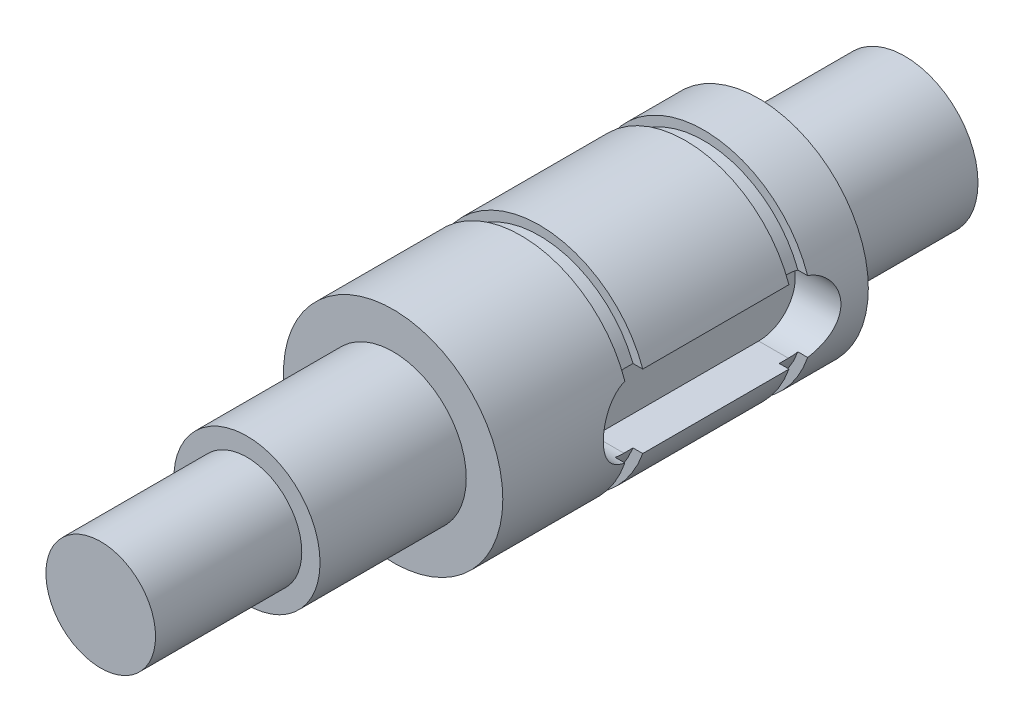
ISO-10303-21;
HEADER;
FILE_DESCRIPTION(('STEP AP214'),'2;1');
FILE_NAME('part.step','',(''),(''),'','','');
FILE_SCHEMA(('AUTOMOTIVE_DESIGN { 1 0 10303 214 1 1 1 1 }'));
ENDSEC;
DATA;
#1=APPLICATION_CONTEXT('core data for automotive mechanical design processes');
#2=APPLICATION_PROTOCOL_DEFINITION('international standard','automotive_design',2000,#1);
#3=PRODUCT_CONTEXT('',#1,'mechanical');
#4=PRODUCT('Part','Part','',(#3));
#5=PRODUCT_RELATED_PRODUCT_CATEGORY('part','',(#4));
#6=PRODUCT_DEFINITION_FORMATION('','',#4);
#7=PRODUCT_DEFINITION_CONTEXT('part definition',#1,'design');
#8=PRODUCT_DEFINITION('design','',#6,#7);
#9=PRODUCT_DEFINITION_SHAPE('','',#8);
#10=(LENGTH_UNIT() NAMED_UNIT(*) SI_UNIT(.MILLI.,.METRE.));
#11=(NAMED_UNIT(*) PLANE_ANGLE_UNIT() SI_UNIT($,.RADIAN.));
#12=(NAMED_UNIT(*) SI_UNIT($,.STERADIAN.) SOLID_ANGLE_UNIT());
#13=UNCERTAINTY_MEASURE_WITH_UNIT(LENGTH_MEASURE(1.E-05),#10,'distance_accuracy_value','');
#14=(GEOMETRIC_REPRESENTATION_CONTEXT(3) GLOBAL_UNCERTAINTY_ASSIGNED_CONTEXT((#13)) GLOBAL_UNIT_ASSIGNED_CONTEXT((#10,
#11,#12)) REPRESENTATION_CONTEXT('',''));
#15=CARTESIAN_POINT('',(0.,0.,0.));
#16=DIRECTION('',(0.,0.,1.));
#17=DIRECTION('',(1.,0.,0.));
#18=AXIS2_PLACEMENT_3D('',#15,#16,#17);
#19=CARTESIAN_POINT('',(0.,1.0547118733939E-12,20.));
#20=DIRECTION('',(0.,0.,-1.));
#21=DIRECTION('',(-1.,0.,0.));
#22=AXIS2_PLACEMENT_3D('',#19,#20,#21);
#23=CYLINDRICAL_SURFACE('',#22,6.);
#24=DIRECTION('',(0.,0.,-1.));
#25=VECTOR('',#24,1.);
#26=CARTESIAN_POINT('',(5.65685424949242,-1.99999999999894,20.));
#27=LINE('',#26,#25);
#28=CARTESIAN_POINT('',(5.65685424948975,-1.99999999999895,12.0000000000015));
#29=VERTEX_POINT('',#28);
#30=CARTESIAN_POINT('',(5.65685424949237,-1.99999999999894,4.00000000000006));
#31=VERTEX_POINT('',#30);
#32=EDGE_CURVE('E655',#29,#31,#27,.T.);
#33=ORIENTED_EDGE('',*,*,#32,.F.);
#34=CARTESIAN_POINT('',(0.,2.92917971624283E-12,12.0000000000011));
#35=DIRECTION('',(0.,1.87517412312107E-13,1.));
#36=DIRECTION('',(0.,-1.,1.87517412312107E-13));
#37=AXIS2_PLACEMENT_3D('',#34,#35,#36);
#38=CIRCLE('',#37,5.99999999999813);
#39=CARTESIAN_POINT('',(5.65685424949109,2.00000000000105,12.0000000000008));
#40=VERTEX_POINT('',#39);
#41=EDGE_CURVE('E511',#40,#29,#38,.T.);
#42=ORIENTED_EDGE('',*,*,#41,.F.);
#43=DIRECTION('',(0.,0.,-1.));
#44=VECTOR('',#43,1.);
#45=CARTESIAN_POINT('',(5.65685424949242,2.00000000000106,20.));
#46=LINE('',#45,#44);
#47=CARTESIAN_POINT('',(5.65685424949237,2.00000000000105,4.));
#48=VERTEX_POINT('',#47);
#49=EDGE_CURVE('E644',#48,#40,#46,.F.);
#50=ORIENTED_EDGE('',*,*,#49,.F.);
#51=CARTESIAN_POINT('',(0.,1.42904041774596E-12,4.00000000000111));
#52=DIRECTION('',(0.,1.87517412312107E-13,1.));
#53=DIRECTION('',(0.,-1.,1.87517412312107E-13));
#54=AXIS2_PLACEMENT_3D('',#51,#52,#53);
#55=CIRCLE('',#54,5.99999999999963);
#56=EDGE_CURVE('E520',#48,#31,#55,.T.);
#57=ORIENTED_EDGE('',*,*,#56,.T.);
#58=EDGE_LOOP('',(#33,#42,#50,#57));
#59=FACE_BOUND('',#58,.T.);
#60=ADVANCED_FACE('F348',(#59),#23,.T.);
#61=CARTESIAN_POINT('',(0.,6.00000000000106,4.));
#62=DIRECTION('',(0.,-1.87517412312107E-13,-1.));
#63=DIRECTION('',(0.,1.,-1.87517412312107E-13));
#64=AXIS2_PLACEMENT_3D('',#61,#62,#63);
#65=PLANE('',#64);
#66=CARTESIAN_POINT('',(0.,1.42904041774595E-12,4.000000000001));
#67=DIRECTION('',(0.,1.87517412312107E-13,1.));
#68=DIRECTION('',(0.,-1.,1.87517412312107E-13));
#69=AXIS2_PLACEMENT_3D('',#66,#67,#68);
#70=CIRCLE('',#69,5.49999999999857);
#71=CARTESIAN_POINT('',(5.12347538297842,2.00000000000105,4.00000000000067));
#72=VERTEX_POINT('',#71);
#73=CARTESIAN_POINT('',(5.12347538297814,-1.99999999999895,4.0000000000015));
#74=VERTEX_POINT('',#73);
#75=EDGE_CURVE('E534',#72,#74,#70,.T.);
#76=ORIENTED_EDGE('',*,*,#75,.T.);
#77=DIRECTION('',(1.,0.,0.));
#78=VECTOR('',#77,1.);
#79=CARTESIAN_POINT('',(0.,-1.99999999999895,4.00000000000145));
#80=LINE('',#79,#78);
#81=EDGE_CURVE('E652',#74,#31,#80,.T.);
#82=ORIENTED_EDGE('',*,*,#81,.T.);
#83=ORIENTED_EDGE('',*,*,#56,.F.);
#84=DIRECTION('',(-1.,0.,0.));
#85=VECTOR('',#84,1.);
#86=CARTESIAN_POINT('',(0.,2.00000000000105,4.00000000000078));
#87=LINE('',#86,#85);
#88=EDGE_CURVE('E642',#48,#72,#87,.T.);
#89=ORIENTED_EDGE('',*,*,#88,.T.);
#90=EDGE_LOOP('',(#76,#82,#83,#89));
#91=FACE_BOUND('',#90,.T.);
#92=ADVANCED_FACE('F583',(#91),#65,.T.);
#93=CARTESIAN_POINT('',(0.,1.0547118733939E-12,2.00376647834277));
#94=DIRECTION('',(0.,1.87517412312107E-13,1.));
#95=DIRECTION('',(0.,-1.,1.87517412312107E-13));
#96=AXIS2_PLACEMENT_3D('',#93,#94,#95);
#97=CYLINDRICAL_SURFACE('',#96,5.49999999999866);
#98=CARTESIAN_POINT('',(5.49999999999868,1.0547118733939E-12,5.49999999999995));
#99=CARTESIAN_POINT('',(5.50000205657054,0.108543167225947,5.50000281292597));
#100=CARTESIAN_POINT('',(5.49675838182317,0.217066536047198,5.49113580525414));
#101=CARTESIAN_POINT('',(5.4841414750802,0.430882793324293,5.45603554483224));
#102=CARTESIAN_POINT('',(5.47476871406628,0.536175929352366,5.42980362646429));
#103=CARTESIAN_POINT('',(5.45090325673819,0.740417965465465,5.36101528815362));
#104=CARTESIAN_POINT('',(5.4364200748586,0.83937825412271,5.31848919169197));
#105=CARTESIAN_POINT('',(5.40378627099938,1.02875621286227,5.21846905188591));
#106=CARTESIAN_POINT('',(5.38563473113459,1.11917173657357,5.16097126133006));
#107=CARTESIAN_POINT('',(5.34673088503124,1.29253694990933,5.03021601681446));
#108=CARTESIAN_POINT('',(5.32590805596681,1.37509612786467,4.95646195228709));
#109=CARTESIAN_POINT('',(5.284366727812,1.52698399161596,4.79634225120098));
#110=CARTESIAN_POINT('',(5.2636482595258,1.59630897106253,4.70997309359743));
#111=CARTESIAN_POINT('',(5.22385385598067,1.72217040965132,4.5233449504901));
#112=CARTESIAN_POINT('',(5.20486193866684,1.77816779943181,4.42270272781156));
#113=CARTESIAN_POINT('',(5.17176122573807,1.87226939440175,4.21262852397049));
#114=CARTESIAN_POINT('',(5.15765061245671,1.91038026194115,4.10319983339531));
#115=CARTESIAN_POINT('',(5.13666087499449,1.96610676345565,3.88314134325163));
#116=CARTESIAN_POINT('',(5.12952103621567,1.9844641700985,3.77272506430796));
#117=CARTESIAN_POINT('',(5.12251577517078,2.00248218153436,3.55016624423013));
#118=CARTESIAN_POINT('',(5.12264757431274,2.00214992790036,3.43802437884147));
#119=CARTESIAN_POINT('',(5.12994485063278,1.98336767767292,3.22184779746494));
#120=CARTESIAN_POINT('',(5.13671788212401,1.96592854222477,3.11770959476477));
#121=CARTESIAN_POINT('',(5.15588510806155,1.91509242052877,2.91395353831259));
#122=CARTESIAN_POINT('',(5.1682800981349,1.88169317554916,2.81433632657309));
#123=CARTESIAN_POINT('',(5.19754287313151,1.79930048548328,2.6203236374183));
#124=CARTESIAN_POINT('',(5.21448789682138,1.75003450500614,2.52605605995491));
#125=CARTESIAN_POINT('',(5.25091385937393,1.6374964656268,2.34682524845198));
#126=CARTESIAN_POINT('',(5.27039563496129,1.57421978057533,2.26186510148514));
#127=CARTESIAN_POINT('',(5.31119569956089,1.4307667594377,2.09804029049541));
#128=CARTESIAN_POINT('',(5.33255243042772,1.34977782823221,2.01989508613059));
#129=CARTESIAN_POINT('',(5.37363749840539,1.17559287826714,1.87808898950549));
#130=CARTESIAN_POINT('',(5.39336561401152,1.08239520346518,1.81443006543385));
#131=CARTESIAN_POINT('',(5.42932219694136,0.884691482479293,1.7026728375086));
#132=CARTESIAN_POINT('',(5.4454987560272,0.780047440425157,1.65480077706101));
#133=CARTESIAN_POINT('',(5.47214720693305,0.563457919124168,1.57757485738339));
#134=CARTESIAN_POINT('',(5.48262147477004,0.451515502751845,1.54821328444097));
#135=CARTESIAN_POINT('',(5.496274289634,0.229572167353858,1.51019398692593));
#136=CARTESIAN_POINT('',(5.499794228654,0.119758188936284,1.50056653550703));
#137=CARTESIAN_POINT('',(5.50018795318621,-0.0999591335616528,1.49948246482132));
#138=CARTESIAN_POINT('',(5.4970631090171,-0.209862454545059,1.50802209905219));
#139=CARTESIAN_POINT('',(5.48474392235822,-0.42253626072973,1.5422834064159));
#140=CARTESIAN_POINT('',(5.47577009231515,-0.525421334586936,1.56738122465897));
#141=CARTESIAN_POINT('',(5.45287588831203,-0.725457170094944,1.63323685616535));
#142=CARTESIAN_POINT('',(5.43895487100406,-0.822607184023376,1.67399670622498));
#143=CARTESIAN_POINT('',(5.40705571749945,-1.01153077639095,1.77129555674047));
#144=CARTESIAN_POINT('',(5.38897272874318,-1.10307043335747,1.8282533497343));
#145=CARTESIAN_POINT('',(5.3507652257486,-1.27559067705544,1.95585309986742));
#146=CARTESIAN_POINT('',(5.33063999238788,-1.3565675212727,2.02649988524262));
#147=CARTESIAN_POINT('',(5.289211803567,-1.51027155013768,2.18400778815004));
#148=CARTESIAN_POINT('',(5.26790441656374,-1.58230898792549,2.27154255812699));
#149=CARTESIAN_POINT('',(5.22759328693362,-1.71079410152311,2.45789098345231));
#150=CARTESIAN_POINT('',(5.20858968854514,-1.76724080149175,2.55670534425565));
#151=CARTESIAN_POINT('',(5.17515419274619,-1.86289185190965,2.76337294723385));
#152=CARTESIAN_POINT('',(5.16073201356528,-1.90205961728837,2.87124479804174));
#153=CARTESIAN_POINT('',(5.13846087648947,-1.96143954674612,3.09271744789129));
#154=CARTESIAN_POINT('',(5.13060817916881,-1.9816624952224,3.20631494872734));
#155=CARTESIAN_POINT('',(5.12284228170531,-2.00164701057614,3.42859130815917));
#156=CARTESIAN_POINT('',(5.12247623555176,-2.00257568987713,3.53715036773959));
#157=CARTESIAN_POINT('',(5.12857566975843,-1.98690232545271,3.75278956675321));
#158=CARTESIAN_POINT('',(5.13504057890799,-1.97030174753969,3.85986982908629));
#159=CARTESIAN_POINT('',(5.15370717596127,-1.92092825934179,4.06659495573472));
#160=CARTESIAN_POINT('',(5.16574946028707,-1.88860353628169,4.16636245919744));
#161=CARTESIAN_POINT('',(5.19413013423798,-1.80908422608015,4.3591227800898));
#162=CARTESIAN_POINT('',(5.21046957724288,-1.76188599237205,4.45211392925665));
#163=CARTESIAN_POINT('',(5.24662240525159,-1.65121147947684,4.63374145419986));
#164=CARTESIAN_POINT('',(5.26656880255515,-1.58703826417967,4.72192639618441));
#165=CARTESIAN_POINT('',(5.30720401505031,-1.44534172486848,4.88665015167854));
#166=CARTESIAN_POINT('',(5.32789305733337,-1.36781428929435,4.96318536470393));
#167=CARTESIAN_POINT('',(5.36891606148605,-1.19700369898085,5.10629946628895));
#168=CARTESIAN_POINT('',(5.38918141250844,-1.10312945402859,5.17219549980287));
#169=CARTESIAN_POINT('',(5.42597802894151,-0.904935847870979,5.28723707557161));
#170=CARTESIAN_POINT('',(5.44250937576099,-0.800616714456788,5.33638298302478));
#171=CARTESIAN_POINT('',(5.47019903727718,-0.582422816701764,5.41690966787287));
#172=CARTESIAN_POINT('',(5.48125425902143,-0.468408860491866,5.44795140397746));
#173=CARTESIAN_POINT('',(5.49615207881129,-0.236254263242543,5.48949064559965));
#174=CARTESIAN_POINT('',(5.49999776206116,-0.118115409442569,5.49999693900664));
#175=CARTESIAN_POINT('',(5.49999999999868,1.0547118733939E-12,5.49999999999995));
#176=B_SPLINE_CURVE_WITH_KNOTS('',3,(#98,#99,#100,#101,#102,#103,#104,#105,#106,#107,#108,#109,
#110,#111,#112,#113,#114,#115,#116,#117,#118,#119,#120,#121,#122,#123,#124,#125,#126,#127,#128,
#129,#130,#131,#132,#133,#134,#135,#136,#137,#138,#139,#140,#141,#142,#143,#144,#145,#146,#147,
#148,#149,#150,#151,#152,#153,#154,#155,#156,#157,#158,#159,#160,#161,#162,#163,#164,#165,#166,
#167,#168,#169,#170,#171,#172,#173,#174,#175),.UNSPECIFIED.,.T.,.F.,(4,2,2,2,2,2,2,2,2,2,2,2,2,
2,2,2,2,2,2,2,2,2,2,2,2,2,2,2,2,2,2,2,2,2,2,2,2,2,4),(0.,0.325194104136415,0.65036322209,
0.974930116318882,1.29957832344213,1.63601964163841,1.97255504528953,2.32099392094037,
2.66930290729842,3.00401939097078,3.33860797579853,3.65454759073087,3.97053193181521,
4.29226244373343,4.61409934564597,4.95617818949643,5.29830348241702,5.64513792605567,
5.99182774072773,6.32102805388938,6.65016048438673,6.96755079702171,7.28498239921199,
7.61151258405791,7.93815814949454,8.28259860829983,8.62706062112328,8.97224851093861,
9.31723978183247,9.64129740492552,9.96532793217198,10.280620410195,10.5959902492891,
10.9271566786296,11.2584252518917,11.6061385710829,11.9538443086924,12.3078682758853,
12.6617407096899),.UNSPECIFIED.);
#177=CARTESIAN_POINT('',(5.14781507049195,-1.93649167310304,3.0000000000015));
#178=VERTEX_POINT('',#177);
#179=CARTESIAN_POINT('',(5.12347538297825,-1.99999999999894,3.5));
#180=VERTEX_POINT('',#179);
#181=EDGE_CURVE('E610',#178,#180,#176,.T.);
#182=ORIENTED_EDGE('',*,*,#181,.T.);
#183=DIRECTION('',(0.,1.87517412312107E-13,1.));
#184=VECTOR('',#183,1.);
#185=CARTESIAN_POINT('',(5.12347538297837,-1.99999999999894,2.00376647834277));
#186=LINE('',#185,#184);
#187=EDGE_CURVE('E654',#180,#74,#186,.T.);
#188=ORIENTED_EDGE('',*,*,#187,.T.);
#189=ORIENTED_EDGE('',*,*,#75,.F.);
#190=DIRECTION('',(0.,1.87517412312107E-13,1.));
#191=VECTOR('',#190,1.);
#192=CARTESIAN_POINT('',(5.12347538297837,2.00000000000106,2.00376647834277));
#193=LINE('',#192,#191);
#194=CARTESIAN_POINT('',(5.12347538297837,2.00000000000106,3.49999999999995));
#195=VERTEX_POINT('',#194);
#196=EDGE_CURVE('E647',#72,#195,#193,.F.);
#197=ORIENTED_EDGE('',*,*,#196,.T.);
#198=CARTESIAN_POINT('',(5.14781507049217,1.93649167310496,3.00000000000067));
#199=VERTEX_POINT('',#198);
#200=EDGE_CURVE('E609',#195,#199,#176,.T.);
#201=ORIENTED_EDGE('',*,*,#200,.T.);
#202=CARTESIAN_POINT('',(0.,1.24152300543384E-12,3.000000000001));
#203=DIRECTION('',(0.,1.87517412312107E-13,1.));
#204=DIRECTION('',(0.,-1.,1.87517412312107E-13));
#205=AXIS2_PLACEMENT_3D('',#202,#203,#204);
#206=CIRCLE('',#205,5.49999999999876);
#207=EDGE_CURVE('E531',#199,#178,#206,.T.);
#208=ORIENTED_EDGE('',*,*,#207,.T.);
#209=EDGE_LOOP('',(#182,#188,#189,#197,#201,#208));
#210=FACE_BOUND('',#209,.T.);
#211=ADVANCED_FACE('F590',(#210),#97,.T.);
#212=CARTESIAN_POINT('',(0.,6.00000000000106,3.));
#213=DIRECTION('',(0.,1.87517412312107E-13,1.));
#214=DIRECTION('',(0.,-1.,1.87517412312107E-13));
#215=AXIS2_PLACEMENT_3D('',#212,#213,#214);
#216=PLANE('',#215);
#217=ORIENTED_EDGE('',*,*,#207,.F.);
#218=DIRECTION('',(-1.,0.,0.));
#219=VECTOR('',#218,1.);
#220=CARTESIAN_POINT('',(6.00000000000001,1.93649167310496,3.00000000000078));
#221=LINE('',#220,#219);
#222=CARTESIAN_POINT('',(5.67890834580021,1.93649167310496,3.00000000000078));
#223=VERTEX_POINT('',#222);
#224=EDGE_CURVE('E373',#199,#223,#221,.F.);
#225=ORIENTED_EDGE('',*,*,#224,.T.);
#226=CARTESIAN_POINT('',(0.,1.24152300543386E-12,3.00000000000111));
#227=DIRECTION('',(0.,1.87517412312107E-13,1.));
#228=DIRECTION('',(0.,-1.,1.87517412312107E-13));
#229=AXIS2_PLACEMENT_3D('',#226,#227,#228);
#230=CIRCLE('',#229,5.99999999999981);
#231=CARTESIAN_POINT('',(5.67890834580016,-1.93649167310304,3.00000000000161));
#232=VERTEX_POINT('',#231);
#233=EDGE_CURVE('E528',#223,#232,#230,.T.);
#234=ORIENTED_EDGE('',*,*,#233,.T.);
#235=DIRECTION('',(-1.,0.,0.));
#236=VECTOR('',#235,1.);
#237=CARTESIAN_POINT('',(6.00000000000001,-1.93649167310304,3.0000000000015));
#238=LINE('',#237,#236);
#239=EDGE_CURVE('E657',#232,#178,#238,.T.);
#240=ORIENTED_EDGE('',*,*,#239,.T.);
#241=EDGE_LOOP('',(#217,#225,#234,#240));
#242=FACE_BOUND('',#241,.T.);
#243=ADVANCED_FACE('F595',(#242),#216,.T.);
#244=CARTESIAN_POINT('',(0.,1.0547118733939E-12,0.));
#245=DIRECTION('',(0.,0.,1.));
#246=DIRECTION('',(1.,0.,0.));
#247=AXIS2_PLACEMENT_3D('',#244,#245,#246);
#248=CIRCLE('',#247,6.);
#249=CARTESIAN_POINT('',(6.,1.0547118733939E-12,0.));
#250=VERTEX_POINT('',#249);
#251=EDGE_CURVE('E552',#250,#250,#248,.T.);
#252=ORIENTED_EDGE('',*,*,#251,.T.);
#253=EDGE_LOOP('',(#252));
#254=FACE_BOUND('',#253,.T.);
#255=CARTESIAN_POINT('',(6.00000000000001,1.0547118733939E-12,5.49999999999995));
#256=CARTESIAN_POINT('',(6.00000030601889,-0.10912672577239,5.50000050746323));
#257=CARTESIAN_POINT('',(5.9969953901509,-0.218250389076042,5.49103946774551));
#258=CARTESIAN_POINT('',(5.98530420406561,-0.433283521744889,5.45554178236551));
#259=CARTESIAN_POINT('',(5.97661734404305,-0.539192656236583,5.42900331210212));
#260=CARTESIAN_POINT('',(5.95450615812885,-0.744665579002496,5.35936151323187));
#261=CARTESIAN_POINT('',(5.94108975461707,-0.844239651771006,5.31628587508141));
#262=CARTESIAN_POINT('',(5.91088891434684,-1.03474987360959,5.21491765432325));
#263=CARTESIAN_POINT('',(5.89410381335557,-1.12568431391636,5.15662206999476));
#264=CARTESIAN_POINT('',(5.85828188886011,-1.29948335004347,5.02434839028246));
#265=CARTESIAN_POINT('',(5.8391911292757,-1.38200740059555,4.94993753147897));
#266=CARTESIAN_POINT('',(5.80120629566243,-1.5336653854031,4.78846569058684));
#267=CARTESIAN_POINT('',(5.78231226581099,-1.60279637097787,4.70140193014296));
#268=CARTESIAN_POINT('',(5.74626664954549,-1.72764988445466,4.51402976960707));
#269=CARTESIAN_POINT('',(5.72918078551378,-1.78292971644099,4.41341252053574));
#270=CARTESIAN_POINT('',(5.69950610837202,-1.87563774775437,4.2036478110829));
#271=CARTESIAN_POINT('',(5.6869159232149,-1.91307139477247,4.09450296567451));
#272=CARTESIAN_POINT('',(5.66822606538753,-1.96774692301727,3.8746535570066));
#273=CARTESIAN_POINT('',(5.66192191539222,-1.98562689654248,3.7641255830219));
#274=CARTESIAN_POINT('',(5.65591313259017,-2.00268224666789,3.54147249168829));
#275=CARTESIAN_POINT('',(5.65620646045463,-2.00186340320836,3.42934787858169));
#276=CARTESIAN_POINT('',(5.66318030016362,-1.98203980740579,3.21212673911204));
#277=CARTESIAN_POINT('',(5.66956831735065,-1.96386782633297,3.10694319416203));
#278=CARTESIAN_POINT('',(5.68753315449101,-1.91121232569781,2.90121316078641));
#279=CARTESIAN_POINT('',(5.69911059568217,-1.87672685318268,2.80066722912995));
#280=CARTESIAN_POINT('',(5.72635822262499,-1.79187811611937,2.6051745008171));
#281=CARTESIAN_POINT('',(5.74209131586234,-1.7412680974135,2.51034394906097));
#282=CARTESIAN_POINT('',(5.77585117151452,-1.62577821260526,2.33025818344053));
#283=CARTESIAN_POINT('',(5.79387859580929,-1.56089422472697,2.24500574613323));
#284=CARTESIAN_POINT('',(5.83134658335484,-1.41469866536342,2.08181680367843));
#285=CARTESIAN_POINT('',(5.85081178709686,-1.33270630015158,2.00449461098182));
#286=CARTESIAN_POINT('',(5.88813876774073,-1.15667913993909,1.86453746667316));
#287=CARTESIAN_POINT('',(5.90600039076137,-1.06264319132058,1.80190392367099));
#288=CARTESIAN_POINT('',(5.93834215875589,-0.863895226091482,1.69260739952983));
#289=CARTESIAN_POINT('',(5.95278700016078,-0.759086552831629,1.64610901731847));
#290=CARTESIAN_POINT('',(5.9764113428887,-0.542538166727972,1.57159365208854));
#291=CARTESIAN_POINT('',(5.98559267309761,-0.430800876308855,1.54357024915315));
#292=CARTESIAN_POINT('',(5.99735254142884,-0.208767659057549,1.50788866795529));
#293=CARTESIAN_POINT('',(6.00020003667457,-0.098619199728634,1.49940038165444));
#294=CARTESIAN_POINT('',(5.99977805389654,0.121550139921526,1.50066534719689));
#295=CARTESIAN_POINT('',(5.99650960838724,0.231571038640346,1.5104155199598));
#296=CARTESIAN_POINT('',(5.98440049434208,0.445039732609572,1.54722381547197));
#297=CARTESIAN_POINT('',(5.97572397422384,0.54858561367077,1.57377241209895));
#298=CARTESIAN_POINT('',(5.9538369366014,0.749711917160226,1.6427868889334));
#299=CARTESIAN_POINT('',(5.9406258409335,0.847291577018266,1.68525479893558));
#300=CARTESIAN_POINT('',(5.91057862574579,1.0365765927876,1.7861408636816));
#301=CARTESIAN_POINT('',(5.89365629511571,1.12805991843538,1.84494918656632));
#302=CARTESIAN_POINT('',(5.85810507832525,1.30012966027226,1.97638830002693));
#303=CARTESIAN_POINT('',(5.83947567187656,1.38071273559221,2.04902331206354));
#304=CARTESIAN_POINT('',(5.8015369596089,1.53250501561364,2.2099575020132));
#305=CARTESIAN_POINT('',(5.78223522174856,1.60312193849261,2.29881845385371));
#306=CARTESIAN_POINT('',(5.74599946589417,1.72851504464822,2.48754313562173));
#307=CARTESIAN_POINT('',(5.72906546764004,1.78329109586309,2.5874069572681));
#308=CARTESIAN_POINT('',(5.69964783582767,1.87519386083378,2.79534603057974));
#309=CARTESIAN_POINT('',(5.68715521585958,1.9123562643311,2.90340415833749));
#310=CARTESIAN_POINT('',(5.66821664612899,1.96778933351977,3.12475730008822));
#311=CARTESIAN_POINT('',(5.66176797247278,1.98606850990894,3.23804993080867));
#312=CARTESIAN_POINT('',(5.65595717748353,2.00255256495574,3.46039419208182));
#313=CARTESIAN_POINT('',(5.6562480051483,2.00174051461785,3.56936468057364));
#314=CARTESIAN_POINT('',(5.66302539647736,1.98248458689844,3.78553014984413));
#315=CARTESIAN_POINT('',(5.66951159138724,1.96404175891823,3.89272523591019));
#316=CARTESIAN_POINT('',(5.68769048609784,1.91074362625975,4.10027132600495));
#317=CARTESIAN_POINT('',(5.69928196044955,1.87620669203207,4.20071365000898));
#318=CARTESIAN_POINT('',(5.72632797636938,1.79195873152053,4.3944548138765));
#319=CARTESIAN_POINT('',(5.7417833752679,1.74224433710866,4.48775206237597));
#320=CARTESIAN_POINT('',(5.77565658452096,1.62652138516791,4.66896733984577));
#321=CARTESIAN_POINT('',(5.79417423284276,1.55989648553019,4.75647300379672));
#322=CARTESIAN_POINT('',(5.83166712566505,1.41328576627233,4.91937962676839));
#323=CARTESIAN_POINT('',(5.85064249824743,1.33329616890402,4.99477715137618));
#324=CARTESIAN_POINT('',(5.88780061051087,1.15848311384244,5.13428882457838));
#325=CARTESIAN_POINT('',(5.90592363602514,1.06320302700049,5.19784869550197));
#326=CARTESIAN_POINT('',(5.93851982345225,0.862714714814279,5.30798085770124));
#327=CARTESIAN_POINT('',(5.95299391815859,0.757509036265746,5.35455749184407));
#328=CARTESIAN_POINT('',(5.97611030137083,0.544987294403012,5.42744326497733));
#329=CARTESIAN_POINT('',(5.98498424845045,0.43797551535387,5.45456493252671));
#330=CARTESIAN_POINT('',(5.99692814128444,0.220640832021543,5.49084056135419));
#331=CARTESIAN_POINT('',(5.99999969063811,0.110318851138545,5.49999948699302));
#332=CARTESIAN_POINT('',(6.00000000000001,1.0547118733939E-12,5.49999999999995));
#333=B_SPLINE_CURVE_WITH_KNOTS('',3,(#255,#256,#257,#258,#259,#260,#261,#262,#263,#264,#265,
#266,#267,#268,#269,#270,#271,#272,#273,#274,#275,#276,#277,#278,#279,#280,#281,#282,#283,#284,
#285,#286,#287,#288,#289,#290,#291,#292,#293,#294,#295,#296,#297,#298,#299,#300,#301,#302,#303,
#304,#305,#306,#307,#308,#309,#310,#311,#312,#313,#314,#315,#316,#317,#318,#319,#320,#321,#322,
#323,#324,#325,#326,#327,#328,#329,#330,#331,#332),.UNSPECIFIED.,.T.,.F.,(4,2,2,2,2,2,2,2,2,2,2,
2,2,2,2,2,2,2,2,2,2,2,2,2,2,2,2,2,2,2,2,2,2,2,2,2,2,2,4),(0.,0.326974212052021,
0.653982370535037,0.980445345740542,1.3069727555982,1.6436936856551,1.98048866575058,
2.32696769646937,2.67334089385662,3.00803851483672,3.34263267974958,3.66193653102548,
3.98127861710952,4.30576342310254,4.63034205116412,4.97186611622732,5.31342291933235,
5.65836811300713,6.00319337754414,6.33307166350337,6.66289426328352,6.98316315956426,
7.30347290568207,7.63220799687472,7.96104361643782,8.30482045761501,8.64860016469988,
8.99168027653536,9.33460569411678,9.65991332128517,9.98520158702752,10.3043117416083,
10.6234927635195,10.9566013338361,11.2898042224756,11.635993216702,11.9820936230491,
12.3127311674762,12.6432773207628),.UNSPECIFIED.);
#334=EDGE_CURVE('E11',#232,#223,#333,.T.);
#335=ORIENTED_EDGE('',*,*,#334,.F.);
#336=ORIENTED_EDGE('',*,*,#233,.F.);
#337=EDGE_LOOP('',(#335,#336));
#338=FACE_BOUND('',#337,.T.);
#339=ADVANCED_FACE('F585',(#254,#338),#23,.T.);
#340=CARTESIAN_POINT('',(0.,6.00000000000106,13.));
#341=DIRECTION('',(0.,-1.87517412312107E-13,-1.));
#342=DIRECTION('',(0.,1.,-1.87517412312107E-13));
#343=AXIS2_PLACEMENT_3D('',#340,#341,#342);
#344=PLANE('',#343);
#345=CARTESIAN_POINT('',(0.,3.11669712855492E-12,13.000000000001));
#346=DIRECTION('',(0.,1.87517412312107E-13,1.));
#347=DIRECTION('',(0.,-1.,1.87517412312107E-13));
#348=AXIS2_PLACEMENT_3D('',#345,#346,#347);
#349=CIRCLE('',#348,5.49999999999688);
#350=CARTESIAN_POINT('',(5.14781507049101,1.93649167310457,13.0000000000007));
#351=VERTEX_POINT('',#350);
#352=CARTESIAN_POINT('',(5.14781507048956,-1.93649167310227,13.0000000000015));
#353=VERTEX_POINT('',#352);
#354=EDGE_CURVE('E517',#351,#353,#349,.T.);
#355=ORIENTED_EDGE('',*,*,#354,.T.);
#356=DIRECTION('',(-1.,0.,0.));
#357=VECTOR('',#356,1.);
#358=CARTESIAN_POINT('',(6.00000000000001,-1.93649167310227,13.0000000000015));
#359=LINE('',#358,#357);
#360=CARTESIAN_POINT('',(5.67890834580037,-1.93649167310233,13.0000000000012));
#361=VERTEX_POINT('',#360);
#362=EDGE_CURVE('E473',#353,#361,#359,.F.);
#363=ORIENTED_EDGE('',*,*,#362,.T.);
#364=CARTESIAN_POINT('',(0.,3.11669712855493E-12,13.0000000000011));
#365=DIRECTION('',(0.,1.87517412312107E-13,1.));
#366=DIRECTION('',(0.,-1.,1.87517412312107E-13));
#367=AXIS2_PLACEMENT_3D('',#364,#365,#366);
#368=CIRCLE('',#367,5.99999999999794);
#369=CARTESIAN_POINT('',(5.67890834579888,1.93649167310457,13.0000000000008));
#370=VERTEX_POINT('',#369);
#371=EDGE_CURVE('E522',#370,#361,#368,.T.);
#372=ORIENTED_EDGE('',*,*,#371,.F.);
#373=DIRECTION('',(-1.,0.,0.));
#374=VECTOR('',#373,1.);
#375=CARTESIAN_POINT('',(6.00000000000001,1.93649167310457,13.0000000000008));
#376=LINE('',#375,#374);
#377=EDGE_CURVE('E366',#370,#351,#376,.T.);
#378=ORIENTED_EDGE('',*,*,#377,.T.);
#379=EDGE_LOOP('',(#355,#363,#372,#378));
#380=FACE_BOUND('',#379,.T.);
#381=ADVANCED_FACE('F594',(#380),#344,.T.);
#382=CARTESIAN_POINT('',(0.,1.0547118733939E-12,2.00376647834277));
#383=DIRECTION('',(0.,1.87517412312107E-13,1.));
#384=DIRECTION('',(0.,-1.,1.87517412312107E-13));
#385=AXIS2_PLACEMENT_3D('',#382,#383,#384);
#386=CYLINDRICAL_SURFACE('',#385,5.49999999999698);
#387=DIRECTION('',(0.,1.87517412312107E-13,1.));
#388=VECTOR('',#387,1.);
#389=CARTESIAN_POINT('',(5.12347538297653,-1.99999999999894,2.00376647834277));
#390=LINE('',#389,#388);
#391=CARTESIAN_POINT('',(5.12347538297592,-1.99999999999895,12.0000000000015));
#392=VERTEX_POINT('',#391);
#393=CARTESIAN_POINT('',(5.12347538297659,-1.99999999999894,12.5000000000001));
#394=VERTEX_POINT('',#393);
#395=EDGE_CURVE('E515',#392,#394,#390,.T.);
#396=ORIENTED_EDGE('',*,*,#395,.T.);
#397=CARTESIAN_POINT('',(5.49999999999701,1.0547118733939E-12,14.5000000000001));
#398=CARTESIAN_POINT('',(5.5000020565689,0.108543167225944,14.5000028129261));
#399=CARTESIAN_POINT('',(5.49675838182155,0.217066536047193,14.4911358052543));
#400=CARTESIAN_POINT('',(5.48414147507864,0.430882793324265,14.4560355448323));
#401=CARTESIAN_POINT('',(5.47476871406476,0.536175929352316,14.4298036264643));
#402=CARTESIAN_POINT('',(5.45090325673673,0.740417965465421,14.3610152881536));
#403=CARTESIAN_POINT('',(5.43642007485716,0.839378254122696,14.3184891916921));
#404=CARTESIAN_POINT('',(5.40378627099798,1.02875621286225,14.2184690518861));
#405=CARTESIAN_POINT('',(5.38563473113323,1.11917173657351,14.1609712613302));
#406=CARTESIAN_POINT('',(5.34673088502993,1.29253694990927,14.0302160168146));
#407=CARTESIAN_POINT('',(5.32590805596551,1.37509612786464,13.9564619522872));
#408=CARTESIAN_POINT('',(5.28436672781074,1.52698399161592,13.7963422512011));
#409=CARTESIAN_POINT('',(5.26364825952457,1.59630897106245,13.7099730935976));
#410=CARTESIAN_POINT('',(5.22385385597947,1.72217040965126,13.5233449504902));
#411=CARTESIAN_POINT('',(5.20486193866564,1.7781677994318,13.4227027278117));
#412=CARTESIAN_POINT('',(5.17176122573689,1.87226939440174,13.2126285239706));
#413=CARTESIAN_POINT('',(5.15765061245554,1.91038026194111,13.1031998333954));
#414=CARTESIAN_POINT('',(5.13666087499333,1.9661067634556,12.8831413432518));
#415=CARTESIAN_POINT('',(5.12952103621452,1.98446417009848,12.7727250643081));
#416=CARTESIAN_POINT('',(5.12251577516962,2.00248218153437,12.5501662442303));
#417=CARTESIAN_POINT('',(5.12264757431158,2.00214992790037,12.4380243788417));
#418=CARTESIAN_POINT('',(5.12994485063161,1.98336767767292,12.2218477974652));
#419=CARTESIAN_POINT('',(5.13671788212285,1.96592854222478,12.117709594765));
#420=CARTESIAN_POINT('',(5.15588510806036,1.91509242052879,11.9139535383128));
#421=CARTESIAN_POINT('',(5.16828009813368,1.8816931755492,11.8143363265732));
#422=CARTESIAN_POINT('',(5.19754287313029,1.79930048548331,11.6203236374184));
#423=CARTESIAN_POINT('',(5.21448789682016,1.75003450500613,11.526056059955));
#424=CARTESIAN_POINT('',(5.2509138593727,1.63749646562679,11.3468252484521));
#425=CARTESIAN_POINT('',(5.27039563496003,1.57421978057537,11.2618651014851));
#426=CARTESIAN_POINT('',(5.31119569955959,1.43076675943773,11.0980402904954));
#427=CARTESIAN_POINT('',(5.33255243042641,1.34977782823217,11.0198950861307));
#428=CARTESIAN_POINT('',(5.37363749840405,1.1755928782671,10.8780889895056));
#429=CARTESIAN_POINT('',(5.39336561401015,1.0823952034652,10.8144300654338));
#430=CARTESIAN_POINT('',(5.42932219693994,0.884691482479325,10.7026728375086));
#431=CARTESIAN_POINT('',(5.44549875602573,0.780047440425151,10.6548007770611));
#432=CARTESIAN_POINT('',(5.47214720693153,0.563457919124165,10.5775748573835));
#433=CARTESIAN_POINT('',(5.48262147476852,0.451515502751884,10.548213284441));
#434=CARTESIAN_POINT('',(5.49627428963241,0.22957216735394,10.5101939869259));
#435=CARTESIAN_POINT('',(5.49979422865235,0.11975818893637,10.5005665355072));
#436=CARTESIAN_POINT('',(5.50018795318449,-0.0999591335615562,10.4994824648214));
#437=CARTESIAN_POINT('',(5.49706310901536,-0.209862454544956,10.5080220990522));
#438=CARTESIAN_POINT('',(5.48474392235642,-0.422536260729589,10.5422834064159));
#439=CARTESIAN_POINT('',(5.47577009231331,-0.525421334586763,10.567381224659));
#440=CARTESIAN_POINT('',(5.45287588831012,-0.725457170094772,10.6332368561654));
#441=CARTESIAN_POINT('',(5.43895487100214,-0.822607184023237,10.6739967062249));
#442=CARTESIAN_POINT('',(5.40705571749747,-1.0115307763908,10.7712955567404));
#443=CARTESIAN_POINT('',(5.38897272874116,-1.10307043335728,10.8282533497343));
#444=CARTESIAN_POINT('',(5.3507652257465,-1.27559067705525,10.9558530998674));
#445=CARTESIAN_POINT('',(5.33063999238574,-1.35656752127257,11.0264998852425));
#446=CARTESIAN_POINT('',(5.2892118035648,-1.51027155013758,11.1840077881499));
#447=CARTESIAN_POINT('',(5.26790441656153,-1.58230898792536,11.2715425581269));
#448=CARTESIAN_POINT('',(5.22759328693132,-1.71079410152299,11.4578909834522));
#449=CARTESIAN_POINT('',(5.20858968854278,-1.76724080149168,11.5567053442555));
#450=CARTESIAN_POINT('',(5.17515419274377,-1.86289185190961,11.7633729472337));
#451=CARTESIAN_POINT('',(5.16073201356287,-1.9020596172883,11.8712447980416));
#452=CARTESIAN_POINT('',(5.13846087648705,-1.96143954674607,12.0927174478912));
#453=CARTESIAN_POINT('',(5.13060817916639,-1.98166249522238,12.2063149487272));
#454=CARTESIAN_POINT('',(5.12284228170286,-2.00164701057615,12.4285913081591));
#455=CARTESIAN_POINT('',(5.12247623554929,-2.00257568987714,12.5371503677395));
#456=CARTESIAN_POINT('',(5.12857566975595,-1.98690232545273,12.7527895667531));
#457=CARTESIAN_POINT('',(5.13504057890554,-1.97030174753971,12.8598698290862));
#458=CARTESIAN_POINT('',(5.15370717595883,-1.92092825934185,13.0665949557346));
#459=CARTESIAN_POINT('',(5.16574946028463,-1.88860353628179,13.1663624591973));
#460=CARTESIAN_POINT('',(5.19413013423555,-1.80908422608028,13.3591227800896));
#461=CARTESIAN_POINT('',(5.21046957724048,-1.76188599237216,13.4521139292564));
#462=CARTESIAN_POINT('',(5.24662240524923,-1.651211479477,13.6337414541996));
#463=CARTESIAN_POINT('',(5.26656880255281,-1.58703826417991,13.7219263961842));
#464=CARTESIAN_POINT('',(5.30720401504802,-1.44534172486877,13.8866501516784));
#465=CARTESIAN_POINT('',(5.32789305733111,-1.3678142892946,13.9631853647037));
#466=CARTESIAN_POINT('',(5.36891606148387,-1.19700369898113,14.1062994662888));
#467=CARTESIAN_POINT('',(5.3891814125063,-1.10312945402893,14.1721954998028));
#468=CARTESIAN_POINT('',(5.42597802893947,-0.904935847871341,14.2872370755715));
#469=CARTESIAN_POINT('',(5.44250937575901,-0.800616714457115,14.3363829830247));
#470=CARTESIAN_POINT('',(5.4701990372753,-0.582422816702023,14.4169096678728));
#471=CARTESIAN_POINT('',(5.48125425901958,-0.468408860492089,14.4479514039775));
#472=CARTESIAN_POINT('',(5.49615207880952,-0.236254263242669,14.4894906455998));
#473=CARTESIAN_POINT('',(5.49999776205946,-0.118115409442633,14.4999969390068));
#474=CARTESIAN_POINT('',(5.49999999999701,1.0547118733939E-12,14.5000000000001));
#475=B_SPLINE_CURVE_WITH_KNOTS('',3,(#397,#398,#399,#400,#401,#402,#403,#404,#405,#406,#407,
#408,#409,#410,#411,#412,#413,#414,#415,#416,#417,#418,#419,#420,#421,#422,#423,#424,#425,#426,
#427,#428,#429,#430,#431,#432,#433,#434,#435,#436,#437,#438,#439,#440,#441,#442,#443,#444,#445,
#446,#447,#448,#449,#450,#451,#452,#453,#454,#455,#456,#457,#458,#459,#460,#461,#462,#463,#464,
#465,#466,#467,#468,#469,#470,#471,#472,#473,#474),.UNSPECIFIED.,.T.,.F.,(4,2,2,2,2,2,2,2,2,2,2,
2,2,2,2,2,2,2,2,2,2,2,2,2,2,2,2,2,2,2,2,2,2,2,2,2,2,2,4),(0.,0.325194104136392,
0.650363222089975,0.974930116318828,1.29957832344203,1.63601964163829,1.97255504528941,
2.32099392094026,2.66930290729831,3.00401939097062,3.33860797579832,3.6545475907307,
3.97053193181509,4.29226244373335,4.61409934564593,4.95617818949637,5.29830348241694,
5.64513792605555,5.99182774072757,6.32102805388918,6.6501604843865,6.96755079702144,
7.28498239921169,7.61151258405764,7.93815814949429,8.28259860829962,8.62706062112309,
8.97224851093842,9.3172397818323,9.64129740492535,9.9653279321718,10.2806204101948,
10.5959902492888,10.9271566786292,11.2584252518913,11.6061385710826,11.9538443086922,
12.3078682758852,12.66174070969),.UNSPECIFIED.);
#476=EDGE_CURVE('E445',#394,#353,#475,.T.);
#477=ORIENTED_EDGE('',*,*,#476,.T.);
#478=ORIENTED_EDGE('',*,*,#354,.F.);
#479=CARTESIAN_POINT('',(5.12347538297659,2.00000000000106,12.5000000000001));
#480=VERTEX_POINT('',#479);
#481=EDGE_CURVE('E481',#351,#480,#475,.T.);
#482=ORIENTED_EDGE('',*,*,#481,.T.);
#483=DIRECTION('',(0.,1.87517412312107E-13,1.));
#484=VECTOR('',#483,1.);
#485=CARTESIAN_POINT('',(5.12347538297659,2.00000000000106,2.00376647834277));
#486=LINE('',#485,#484);
#487=CARTESIAN_POINT('',(5.12347538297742,2.00000000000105,12.0000000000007));
#488=VERTEX_POINT('',#487);
#489=EDGE_CURVE('E482',#480,#488,#486,.F.);
#490=ORIENTED_EDGE('',*,*,#489,.T.);
#491=CARTESIAN_POINT('',(0.,2.92917971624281E-12,12.000000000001));
#492=DIRECTION('',(0.,1.87517412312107E-13,1.));
#493=DIRECTION('',(0.,-1.,1.87517412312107E-13));
#494=AXIS2_PLACEMENT_3D('',#491,#492,#493);
#495=CIRCLE('',#494,5.49999999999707);
#496=EDGE_CURVE('E509',#488,#392,#495,.T.);
#497=ORIENTED_EDGE('',*,*,#496,.T.);
#498=EDGE_LOOP('',(#396,#477,#478,#482,#490,#497));
#499=FACE_BOUND('',#498,.T.);
#500=ADVANCED_FACE('F484',(#499),#386,.T.);
#501=CARTESIAN_POINT('',(0.,6.00000000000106,12.));
#502=DIRECTION('',(0.,1.87517412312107E-13,1.));
#503=DIRECTION('',(0.,-1.,1.87517412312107E-13));
#504=AXIS2_PLACEMENT_3D('',#501,#502,#503);
#505=PLANE('',#504);
#506=ORIENTED_EDGE('',*,*,#41,.T.);
#507=DIRECTION('',(-1.,0.,0.));
#508=VECTOR('',#507,1.);
#509=CARTESIAN_POINT('',(0.,-1.99999999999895,12.0000000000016));
#510=LINE('',#509,#508);
#511=EDGE_CURVE('E359',#29,#392,#510,.T.);
#512=ORIENTED_EDGE('',*,*,#511,.T.);
#513=ORIENTED_EDGE('',*,*,#496,.F.);
#514=DIRECTION('',(1.,0.,0.));
#515=VECTOR('',#514,1.);
#516=CARTESIAN_POINT('',(0.,2.00000000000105,12.0000000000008));
#517=LINE('',#516,#515);
#518=EDGE_CURVE('E500',#488,#40,#517,.T.);
#519=ORIENTED_EDGE('',*,*,#518,.T.);
#520=EDGE_LOOP('',(#506,#512,#513,#519));
#521=FACE_BOUND('',#520,.T.);
#522=ADVANCED_FACE('F492',(#521),#505,.T.);
#523=CARTESIAN_POINT('',(0.,1.0547118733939E-12,20.));
#524=DIRECTION('',(0.,0.,1.));
#525=DIRECTION('',(1.,0.,0.));
#526=AXIS2_PLACEMENT_3D('',#523,#524,#525);
#527=CIRCLE('',#526,6.);
#528=CARTESIAN_POINT('',(6.,1.0547118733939E-12,20.));
#529=VERTEX_POINT('',#528);
#530=EDGE_CURVE('E554',#529,#529,#527,.T.);
#531=ORIENTED_EDGE('',*,*,#530,.F.);
#532=EDGE_LOOP('',(#531));
#533=FACE_BOUND('',#532,.T.);
#534=ORIENTED_EDGE('',*,*,#371,.T.);
#535=CARTESIAN_POINT('',(6.00000000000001,1.0547118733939E-12,14.5000000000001));
#536=CARTESIAN_POINT('',(6.00000030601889,-0.109126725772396,14.5000005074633));
#537=CARTESIAN_POINT('',(5.9969953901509,-0.218250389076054,14.4910394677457));
#538=CARTESIAN_POINT('',(5.98530420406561,-0.433283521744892,14.4555417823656));
#539=CARTESIAN_POINT('',(5.97661734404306,-0.53919265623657,14.4290033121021));
#540=CARTESIAN_POINT('',(5.95450615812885,-0.744665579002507,14.3593615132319));
#541=CARTESIAN_POINT('',(5.94108975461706,-0.844239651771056,14.3162858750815));
#542=CARTESIAN_POINT('',(5.91088891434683,-1.03474987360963,14.2149176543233));
#543=CARTESIAN_POINT('',(5.89410381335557,-1.12568431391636,14.1566220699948));
#544=CARTESIAN_POINT('',(5.85828188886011,-1.29948335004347,14.0243483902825));
#545=CARTESIAN_POINT('',(5.83919112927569,-1.3820074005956,13.949937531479));
#546=CARTESIAN_POINT('',(5.80120629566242,-1.53366538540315,13.7884656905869));
#547=CARTESIAN_POINT('',(5.782312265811,-1.60279637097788,13.701401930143));
#548=CARTESIAN_POINT('',(5.74626664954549,-1.72764988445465,13.5140297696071));
#549=CARTESIAN_POINT('',(5.72918078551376,-1.78292971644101,13.4134125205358));
#550=CARTESIAN_POINT('',(5.69950610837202,-1.8756377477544,13.203647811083));
#551=CARTESIAN_POINT('',(5.68691592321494,-1.91307139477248,13.0945029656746));
#552=CARTESIAN_POINT('',(5.66822606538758,-1.96774692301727,12.8746535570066));
#553=CARTESIAN_POINT('',(5.66192191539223,-1.98562689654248,12.7641255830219));
#554=CARTESIAN_POINT('',(5.65591313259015,-2.0026822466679,12.5414724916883));
#555=CARTESIAN_POINT('',(5.65620646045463,-2.00186340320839,12.4293478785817));
#556=CARTESIAN_POINT('',(5.66318030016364,-1.98203980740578,12.212126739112));
#557=CARTESIAN_POINT('',(5.66956831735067,-1.96386782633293,12.106943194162));
#558=CARTESIAN_POINT('',(5.68753315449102,-1.91121232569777,11.9012131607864));
#559=CARTESIAN_POINT('',(5.69911059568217,-1.87672685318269,11.8006672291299));
#560=CARTESIAN_POINT('',(5.72635822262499,-1.79187811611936,11.6051745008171));
#561=CARTESIAN_POINT('',(5.74209131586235,-1.74126809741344,11.510343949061));
#562=CARTESIAN_POINT('',(5.77585117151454,-1.6257782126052,11.3302581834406));
#563=CARTESIAN_POINT('',(5.79387859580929,-1.56089422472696,11.2450057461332));
#564=CARTESIAN_POINT('',(5.83134658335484,-1.41469866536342,11.0818168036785));
#565=CARTESIAN_POINT('',(5.85081178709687,-1.33270630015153,11.0044946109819));
#566=CARTESIAN_POINT('',(5.88813876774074,-1.15667913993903,10.8645374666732));
#567=CARTESIAN_POINT('',(5.90600039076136,-1.06264319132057,10.801903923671));
#568=CARTESIAN_POINT('',(5.93834215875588,-0.863895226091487,10.6926073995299));
#569=CARTESIAN_POINT('',(5.95278700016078,-0.7590865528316,10.6461090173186));
#570=CARTESIAN_POINT('',(5.97641134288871,-0.542538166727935,10.5715936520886));
#571=CARTESIAN_POINT('',(5.98559267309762,-0.430800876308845,10.5435702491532));
#572=CARTESIAN_POINT('',(5.99735254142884,-0.208767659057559,10.5078886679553));
#573=CARTESIAN_POINT('',(6.00020003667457,-0.0986191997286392,10.4994003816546));
#574=CARTESIAN_POINT('',(5.99977805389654,0.121550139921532,10.500665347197));
#575=CARTESIAN_POINT('',(5.99650960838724,0.231571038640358,10.5104155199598));
#576=CARTESIAN_POINT('',(5.98440049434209,0.445039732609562,10.547223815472));
#577=CARTESIAN_POINT('',(5.97572397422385,0.548585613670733,10.5737724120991));
#578=CARTESIAN_POINT('',(5.9538369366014,0.749711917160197,10.6427868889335));
#579=CARTESIAN_POINT('',(5.94062584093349,0.847291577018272,10.6852547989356));
#580=CARTESIAN_POINT('',(5.91057862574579,1.0365765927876,10.7861408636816));
#581=CARTESIAN_POINT('',(5.89365629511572,1.12805991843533,10.8449491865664));
#582=CARTESIAN_POINT('',(5.85810507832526,1.30012966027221,10.976388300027));
#583=CARTESIAN_POINT('',(5.83947567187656,1.38071273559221,11.0490233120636));
#584=CARTESIAN_POINT('',(5.8015369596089,1.53250501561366,11.2099575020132));
#585=CARTESIAN_POINT('',(5.78223522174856,1.60312193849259,11.2988184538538));
#586=CARTESIAN_POINT('',(5.74599946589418,1.72851504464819,11.4875431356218));
#587=CARTESIAN_POINT('',(5.72906546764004,1.78329109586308,11.5874069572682));
#588=CARTESIAN_POINT('',(5.69964783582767,1.87519386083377,11.7953460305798));
#589=CARTESIAN_POINT('',(5.68715521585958,1.91235626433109,11.9034041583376));
#590=CARTESIAN_POINT('',(5.66821664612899,1.96778933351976,12.1247573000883));
#591=CARTESIAN_POINT('',(5.66176797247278,1.98606850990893,12.2380499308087));
#592=CARTESIAN_POINT('',(5.65595717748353,2.00255256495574,12.4603941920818));
#593=CARTESIAN_POINT('',(5.65624800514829,2.00174051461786,12.5693646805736));
#594=CARTESIAN_POINT('',(5.66302539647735,1.98248458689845,12.7855301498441));
#595=CARTESIAN_POINT('',(5.66951159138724,1.96404175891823,12.8927252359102));
#596=CARTESIAN_POINT('',(5.68769048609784,1.91074362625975,13.100271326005));
#597=CARTESIAN_POINT('',(5.69928196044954,1.87620669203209,13.200713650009));
#598=CARTESIAN_POINT('',(5.72632797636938,1.79195873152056,13.3944548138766));
#599=CARTESIAN_POINT('',(5.7417833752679,1.74224433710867,13.4877520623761));
#600=CARTESIAN_POINT('',(5.77565658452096,1.62652138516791,13.6689673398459));
#601=CARTESIAN_POINT('',(5.79417423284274,1.55989648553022,13.7564730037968));
#602=CARTESIAN_POINT('',(5.83166712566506,1.41328576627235,13.9193796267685));
#603=CARTESIAN_POINT('',(5.85064249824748,1.33329616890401,13.9947771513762));
#604=CARTESIAN_POINT('',(5.88780061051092,1.15848311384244,14.1342888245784));
#605=CARTESIAN_POINT('',(5.90592363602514,1.06320302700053,14.1978486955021));
#606=CARTESIAN_POINT('',(5.93851982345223,0.862714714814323,14.3079808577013));
#607=CARTESIAN_POINT('',(5.9529939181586,0.757509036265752,14.3545574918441));
#608=CARTESIAN_POINT('',(5.97611030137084,0.544987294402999,14.4274432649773));
#609=CARTESIAN_POINT('',(5.98498424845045,0.437975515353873,14.4545649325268));
#610=CARTESIAN_POINT('',(5.99692814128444,0.220640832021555,14.4908405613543));
#611=CARTESIAN_POINT('',(5.99999969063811,0.110318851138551,14.4999994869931));
#612=CARTESIAN_POINT('',(6.00000000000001,1.0547118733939E-12,14.5000000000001));
#613=B_SPLINE_CURVE_WITH_KNOTS('',3,(#535,#536,#537,#538,#539,#540,#541,#542,#543,#544,#545,
#546,#547,#548,#549,#550,#551,#552,#553,#554,#555,#556,#557,#558,#559,#560,#561,#562,#563,#564,
#565,#566,#567,#568,#569,#570,#571,#572,#573,#574,#575,#576,#577,#578,#579,#580,#581,#582,#583,
#584,#585,#586,#587,#588,#589,#590,#591,#592,#593,#594,#595,#596,#597,#598,#599,#600,#601,#602,
#603,#604,#605,#606,#607,#608,#609,#610,#611,#612),.UNSPECIFIED.,.T.,.F.,(4,2,2,2,2,2,2,2,2,2,2,
2,2,2,2,2,2,2,2,2,2,2,2,2,2,2,2,2,2,2,2,2,2,2,2,2,2,2,4),(0.,0.326974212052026,
0.653982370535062,0.980445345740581,1.30697275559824,1.64369368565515,1.98048866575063,
2.3269676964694,2.67334089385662,3.00803851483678,3.3426326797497,3.6619365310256,
3.98127861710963,4.30576342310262,4.63034205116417,4.97186611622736,5.31342291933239,
5.65836811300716,6.00319337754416,6.33307166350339,6.66289426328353,6.98316315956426,
7.30347290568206,7.63220799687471,7.9610436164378,8.30482045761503,8.64860016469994,
8.99168027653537,9.33460569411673,9.65991332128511,9.98520158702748,10.3043117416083,
10.6234927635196,10.9566013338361,11.2898042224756,11.635993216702,11.9820936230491,
12.3127311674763,12.6432773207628),.UNSPECIFIED.);
#614=EDGE_CURVE('E495',#370,#361,#613,.T.);
#615=ORIENTED_EDGE('',*,*,#614,.F.);
#616=EDGE_LOOP('',(#534,#615));
#617=FACE_BOUND('',#616,.T.);
#618=ADVANCED_FACE('F586',(#533,#617),#23,.T.);
#619=CARTESIAN_POINT('',(0.,1.0547118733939E-12,-8.00000000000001));
#620=DIRECTION('',(0.,0.,1.));
#621=DIRECTION('',(1.,0.,0.));
#622=AXIS2_PLACEMENT_3D('',#619,#620,#621);
#623=PLANE('',#622);
#624=CARTESIAN_POINT('',(0.,1.0547118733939E-12,-8.00000000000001));
#625=DIRECTION('',(0.,0.,1.));
#626=DIRECTION('',(1.,0.,0.));
#627=AXIS2_PLACEMENT_3D('',#624,#625,#626);
#628=CIRCLE('',#627,4.);
#629=CARTESIAN_POINT('',(4.,1.0547118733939E-12,-8.00000000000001));
#630=VERTEX_POINT('',#629);
#631=EDGE_CURVE('E543',#630,#630,#628,.T.);
#632=ORIENTED_EDGE('',*,*,#631,.F.);
#633=EDGE_LOOP('',(#632));
#634=FACE_BOUND('',#633,.T.);
#635=ADVANCED_FACE('F577',(#634),#623,.F.);
#636=CARTESIAN_POINT('',(0.,1.0547118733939E-12,28.));
#637=DIRECTION('',(0.,0.,-1.));
#638=DIRECTION('',(-1.,0.,0.));
#639=AXIS2_PLACEMENT_3D('',#636,#637,#638);
#640=CYLINDRICAL_SURFACE('',#639,4.);
#641=ORIENTED_EDGE('',*,*,#631,.T.);
#642=EDGE_LOOP('',(#641));
#643=FACE_BOUND('',#642,.T.);
#644=CARTESIAN_POINT('',(0.,1.0547118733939E-12,0.));
#645=DIRECTION('',(0.,0.,1.));
#646=DIRECTION('',(1.,0.,0.));
#647=AXIS2_PLACEMENT_3D('',#644,#645,#646);
#648=CIRCLE('',#647,4.);
#649=CARTESIAN_POINT('',(4.,1.0547118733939E-12,0.));
#650=VERTEX_POINT('',#649);
#651=EDGE_CURVE('E501',#650,#650,#648,.F.);
#652=ORIENTED_EDGE('',*,*,#651,.T.);
#653=EDGE_LOOP('',(#652));
#654=FACE_BOUND('',#653,.T.);
#655=ADVANCED_FACE('F561',(#643,#654),#640,.T.);
#656=CARTESIAN_POINT('',(0.,1.0547118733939E-12,0.));
#657=DIRECTION('',(0.,0.,1.));
#658=DIRECTION('',(1.,0.,0.));
#659=AXIS2_PLACEMENT_3D('',#656,#657,#658);
#660=PLANE('',#659);
#661=ORIENTED_EDGE('',*,*,#251,.F.);
#662=EDGE_LOOP('',(#661));
#663=FACE_BOUND('',#662,.T.);
#664=ORIENTED_EDGE('',*,*,#651,.F.);
#665=EDGE_LOOP('',(#664));
#666=FACE_BOUND('',#665,.T.);
#667=ADVANCED_FACE('F563',(#663,#666),#660,.F.);
#668=CARTESIAN_POINT('',(-4.9960036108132E-13,1.0547118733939E-12,36.));
#669=DIRECTION('',(0.,0.,1.));
#670=DIRECTION('',(1.,0.,0.));
#671=AXIS2_PLACEMENT_3D('',#668,#669,#670);
#672=PLANE('',#671);
#673=CARTESIAN_POINT('',(-4.9960036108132E-13,1.0547118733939E-12,36.));
#674=DIRECTION('',(0.,0.,1.));
#675=DIRECTION('',(1.,0.,0.));
#676=AXIS2_PLACEMENT_3D('',#673,#674,#675);
#677=CIRCLE('',#676,3.);
#678=CARTESIAN_POINT('',(2.9999999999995,1.0547118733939E-12,36.));
#679=VERTEX_POINT('',#678);
#680=EDGE_CURVE('E540',#679,#679,#677,.T.);
#681=ORIENTED_EDGE('',*,*,#680,.T.);
#682=EDGE_LOOP('',(#681));
#683=FACE_BOUND('',#682,.T.);
#684=ADVANCED_FACE('F565',(#683),#672,.T.);
#685=CARTESIAN_POINT('',(-4.9960036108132E-13,1.0547118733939E-12,36.));
#686=DIRECTION('',(0.,0.,-1.));
#687=DIRECTION('',(-1.,0.,0.));
#688=AXIS2_PLACEMENT_3D('',#685,#686,#687);
#689=CYLINDRICAL_SURFACE('',#688,3.);
#690=ORIENTED_EDGE('',*,*,#680,.F.);
#691=EDGE_LOOP('',(#690));
#692=FACE_BOUND('',#691,.T.);
#693=CARTESIAN_POINT('',(0.,1.0547118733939E-12,28.));
#694=DIRECTION('',(0.,0.,1.));
#695=DIRECTION('',(1.,0.,0.));
#696=AXIS2_PLACEMENT_3D('',#693,#694,#695);
#697=CIRCLE('',#696,3.);
#698=CARTESIAN_POINT('',(3.,1.0547118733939E-12,28.));
#699=VERTEX_POINT('',#698);
#700=EDGE_CURVE('E537',#699,#699,#697,.T.);
#701=ORIENTED_EDGE('',*,*,#700,.T.);
#702=EDGE_LOOP('',(#701));
#703=FACE_BOUND('',#702,.T.);
#704=ADVANCED_FACE('F573',(#692,#703),#689,.T.);
#705=CARTESIAN_POINT('',(0.,1.0547118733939E-12,28.));
#706=DIRECTION('',(0.,0.,1.));
#707=DIRECTION('',(1.,0.,0.));
#708=AXIS2_PLACEMENT_3D('',#705,#706,#707);
#709=PLANE('',#708);
#710=CARTESIAN_POINT('',(0.,1.0547118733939E-12,28.));
#711=DIRECTION('',(0.,0.,1.));
#712=DIRECTION('',(1.,0.,0.));
#713=AXIS2_PLACEMENT_3D('',#710,#711,#712);
#714=CIRCLE('',#713,4.);
#715=CARTESIAN_POINT('',(4.,1.0547118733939E-12,28.));
#716=VERTEX_POINT('',#715);
#717=EDGE_CURVE('E546',#716,#716,#714,.T.);
#718=ORIENTED_EDGE('',*,*,#717,.T.);
#719=EDGE_LOOP('',(#718));
#720=FACE_BOUND('',#719,.T.);
#721=ORIENTED_EDGE('',*,*,#700,.F.);
#722=EDGE_LOOP('',(#721));
#723=FACE_BOUND('',#722,.T.);
#724=ADVANCED_FACE('F690',(#720,#723),#709,.T.);
#725=CARTESIAN_POINT('',(0.,1.0547118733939E-12,20.));
#726=DIRECTION('',(0.,0.,1.));
#727=DIRECTION('',(1.,0.,0.));
#728=AXIS2_PLACEMENT_3D('',#725,#726,#727);
#729=CIRCLE('',#728,4.);
#730=CARTESIAN_POINT('',(4.,1.0547118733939E-12,20.));
#731=VERTEX_POINT('',#730);
#732=EDGE_CURVE('E549',#731,#731,#729,.F.);
#733=ORIENTED_EDGE('',*,*,#732,.F.);
#734=EDGE_LOOP('',(#733));
#735=FACE_BOUND('',#734,.T.);
#736=ORIENTED_EDGE('',*,*,#717,.F.);
#737=EDGE_LOOP('',(#736));
#738=FACE_BOUND('',#737,.T.);
#739=ADVANCED_FACE('F580',(#735,#738),#640,.T.);
#740=CARTESIAN_POINT('',(0.,1.0547118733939E-12,20.));
#741=DIRECTION('',(0.,0.,1.));
#742=DIRECTION('',(1.,0.,0.));
#743=AXIS2_PLACEMENT_3D('',#740,#741,#742);
#744=PLANE('',#743);
#745=ORIENTED_EDGE('',*,*,#530,.T.);
#746=EDGE_LOOP('',(#745));
#747=FACE_BOUND('',#746,.T.);
#748=ORIENTED_EDGE('',*,*,#732,.T.);
#749=EDGE_LOOP('',(#748));
#750=FACE_BOUND('',#749,.T.);
#751=ADVANCED_FACE('F491',(#747,#750),#744,.T.);
#752=CARTESIAN_POINT('',(6.00000000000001,1.0547118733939E-12,12.5000000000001));
#753=DIRECTION('',(-1.,0.,0.));
#754=DIRECTION('',(0.,0.,1.));
#755=AXIS2_PLACEMENT_3D('',#752,#753,#754);
#756=CYLINDRICAL_SURFACE('',#755,2.);
#757=ORIENTED_EDGE('',*,*,#377,.F.);
#758=ORIENTED_EDGE('',*,*,#614,.T.);
#759=ORIENTED_EDGE('',*,*,#362,.F.);
#760=ORIENTED_EDGE('',*,*,#476,.F.);
#761=DIRECTION('',(-1.,0.,0.));
#762=VECTOR('',#761,1.);
#763=CARTESIAN_POINT('',(6.00000000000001,-1.99999999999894,12.5000000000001));
#764=LINE('',#763,#762);
#765=CARTESIAN_POINT('',(3.5,-1.99999999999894,12.5000000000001));
#766=VERTEX_POINT('',#765);
#767=EDGE_CURVE('E438',#394,#766,#764,.T.);
#768=ORIENTED_EDGE('',*,*,#767,.T.);
#769=CARTESIAN_POINT('',(3.5,1.0547118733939E-12,12.5000000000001));
#770=DIRECTION('',(1.,0.,0.));
#771=DIRECTION('',(0.,0.,-1.));
#772=AXIS2_PLACEMENT_3D('',#769,#770,#771);
#773=CIRCLE('',#772,2.);
#774=CARTESIAN_POINT('',(3.5,2.00000000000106,12.5));
#775=VERTEX_POINT('',#774);
#776=EDGE_CURVE('E443',#775,#766,#773,.T.);
#777=ORIENTED_EDGE('',*,*,#776,.F.);
#778=DIRECTION('',(-1.,0.,0.));
#779=VECTOR('',#778,1.);
#780=CARTESIAN_POINT('',(6.00000000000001,2.00000000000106,12.5000000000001));
#781=LINE('',#780,#779);
#782=EDGE_CURVE('E467',#480,#775,#781,.T.);
#783=ORIENTED_EDGE('',*,*,#782,.F.);
#784=ORIENTED_EDGE('',*,*,#481,.F.);
#785=EDGE_LOOP('',(#757,#758,#759,#760,#768,#777,#783,#784));
#786=FACE_BOUND('',#785,.T.);
#787=ADVANCED_FACE('F440',(#786),#756,.F.);
#788=CARTESIAN_POINT('',(6.00000000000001,-1.99999999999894,12.5000000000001));
#789=DIRECTION('',(0.,1.,0.));
#790=DIRECTION('',(0.,0.,1.));
#791=AXIS2_PLACEMENT_3D('',#788,#789,#790);
#792=PLANE('',#791);
#793=DIRECTION('',(-1.,0.,0.));
#794=VECTOR('',#793,1.);
#795=CARTESIAN_POINT('',(6.00000000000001,-1.99999999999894,3.5));
#796=LINE('',#795,#794);
#797=CARTESIAN_POINT('',(3.5,-1.99999999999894,3.49999999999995));
#798=VERTEX_POINT('',#797);
#799=EDGE_CURVE('E448',#180,#798,#796,.T.);
#800=ORIENTED_EDGE('',*,*,#799,.T.);
#801=DIRECTION('',(0.,0.,-1.));
#802=VECTOR('',#801,1.);
#803=CARTESIAN_POINT('',(3.5,-1.99999999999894,12.5000000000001));
#804=LINE('',#803,#802);
#805=EDGE_CURVE('E451',#766,#798,#804,.T.);
#806=ORIENTED_EDGE('',*,*,#805,.F.);
#807=ORIENTED_EDGE('',*,*,#767,.F.);
#808=ORIENTED_EDGE('',*,*,#395,.F.);
#809=ORIENTED_EDGE('',*,*,#511,.F.);
#810=ORIENTED_EDGE('',*,*,#32,.T.);
#811=ORIENTED_EDGE('',*,*,#81,.F.);
#812=ORIENTED_EDGE('',*,*,#187,.F.);
#813=EDGE_LOOP('',(#800,#806,#807,#808,#809,#810,#811,#812));
#814=FACE_BOUND('',#813,.T.);
#815=ADVANCED_FACE('F452',(#814),#792,.T.);
#816=CARTESIAN_POINT('',(6.00000000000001,1.0547118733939E-12,3.49999999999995));
#817=DIRECTION('',(-1.,0.,0.));
#818=DIRECTION('',(0.,0.,1.));
#819=AXIS2_PLACEMENT_3D('',#816,#817,#818);
#820=CYLINDRICAL_SURFACE('',#819,2.);
#821=DIRECTION('',(-1.,0.,0.));
#822=VECTOR('',#821,1.);
#823=CARTESIAN_POINT('',(6.00000000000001,2.00000000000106,3.49999999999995));
#824=LINE('',#823,#822);
#825=CARTESIAN_POINT('',(3.5,2.00000000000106,3.49999999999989));
#826=VERTEX_POINT('',#825);
#827=EDGE_CURVE('E469',#195,#826,#824,.T.);
#828=ORIENTED_EDGE('',*,*,#827,.T.);
#829=CARTESIAN_POINT('',(3.5,1.0547118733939E-12,3.49999999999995));
#830=DIRECTION('',(1.,0.,0.));
#831=DIRECTION('',(0.,0.,-1.));
#832=AXIS2_PLACEMENT_3D('',#829,#830,#831);
#833=CIRCLE('',#832,2.);
#834=EDGE_CURVE('E457',#798,#826,#833,.T.);
#835=ORIENTED_EDGE('',*,*,#834,.F.);
#836=ORIENTED_EDGE('',*,*,#799,.F.);
#837=ORIENTED_EDGE('',*,*,#181,.F.);
#838=ORIENTED_EDGE('',*,*,#239,.F.);
#839=ORIENTED_EDGE('',*,*,#334,.T.);
#840=ORIENTED_EDGE('',*,*,#224,.F.);
#841=ORIENTED_EDGE('',*,*,#200,.F.);
#842=EDGE_LOOP('',(#828,#835,#836,#837,#838,#839,#840,#841));
#843=FACE_BOUND('',#842,.T.);
#844=ADVANCED_FACE('F620',(#843),#820,.F.);
#845=CARTESIAN_POINT('',(6.00000000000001,2.00000000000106,12.5000000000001));
#846=DIRECTION('',(0.,-1.,0.));
#847=DIRECTION('',(0.,0.,-1.));
#848=AXIS2_PLACEMENT_3D('',#845,#846,#847);
#849=PLANE('',#848);
#850=ORIENTED_EDGE('',*,*,#88,.F.);
#851=ORIENTED_EDGE('',*,*,#49,.T.);
#852=ORIENTED_EDGE('',*,*,#518,.F.);
#853=ORIENTED_EDGE('',*,*,#489,.F.);
#854=ORIENTED_EDGE('',*,*,#782,.T.);
#855=DIRECTION('',(0.,0.,1.));
#856=VECTOR('',#855,1.);
#857=CARTESIAN_POINT('',(3.5,2.00000000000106,12.5));
#858=LINE('',#857,#856);
#859=EDGE_CURVE('E462',#826,#775,#858,.T.);
#860=ORIENTED_EDGE('',*,*,#859,.F.);
#861=ORIENTED_EDGE('',*,*,#827,.F.);
#862=ORIENTED_EDGE('',*,*,#196,.F.);
#863=EDGE_LOOP('',(#850,#851,#852,#853,#854,#860,#861,#862));
#864=FACE_BOUND('',#863,.T.);
#865=ADVANCED_FACE('F624',(#864),#849,.T.);
#866=CARTESIAN_POINT('',(3.5,1.0547118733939E-12,12.5000000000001));
#867=DIRECTION('',(1.,0.,0.));
#868=DIRECTION('',(0.,0.,-1.));
#869=AXIS2_PLACEMENT_3D('',#866,#867,#868);
#870=PLANE('',#869);
#871=ORIENTED_EDGE('',*,*,#776,.T.);
#872=ORIENTED_EDGE('',*,*,#805,.T.);
#873=ORIENTED_EDGE('',*,*,#834,.T.);
#874=ORIENTED_EDGE('',*,*,#859,.T.);
#875=EDGE_LOOP('',(#871,#872,#873,#874));
#876=FACE_BOUND('',#875,.T.);
#877=ADVANCED_FACE('F460',(#876),#870,.T.);
#878=CLOSED_SHELL('',(#60,#92,#211,#243,#339,#381,#500,#522,#618,#635,#655,#667,#684,#704,#724,
#739,#751,#787,#815,#844,#865,#877));
#879=MANIFOLD_SOLID_BREP('B2',#878);
#880=ADVANCED_BREP_SHAPE_REPRESENTATION('',(#18,#879),#14);
#881=SHAPE_DEFINITION_REPRESENTATION(#9,#880);
ENDSEC;
END-ISO-10303-21;
